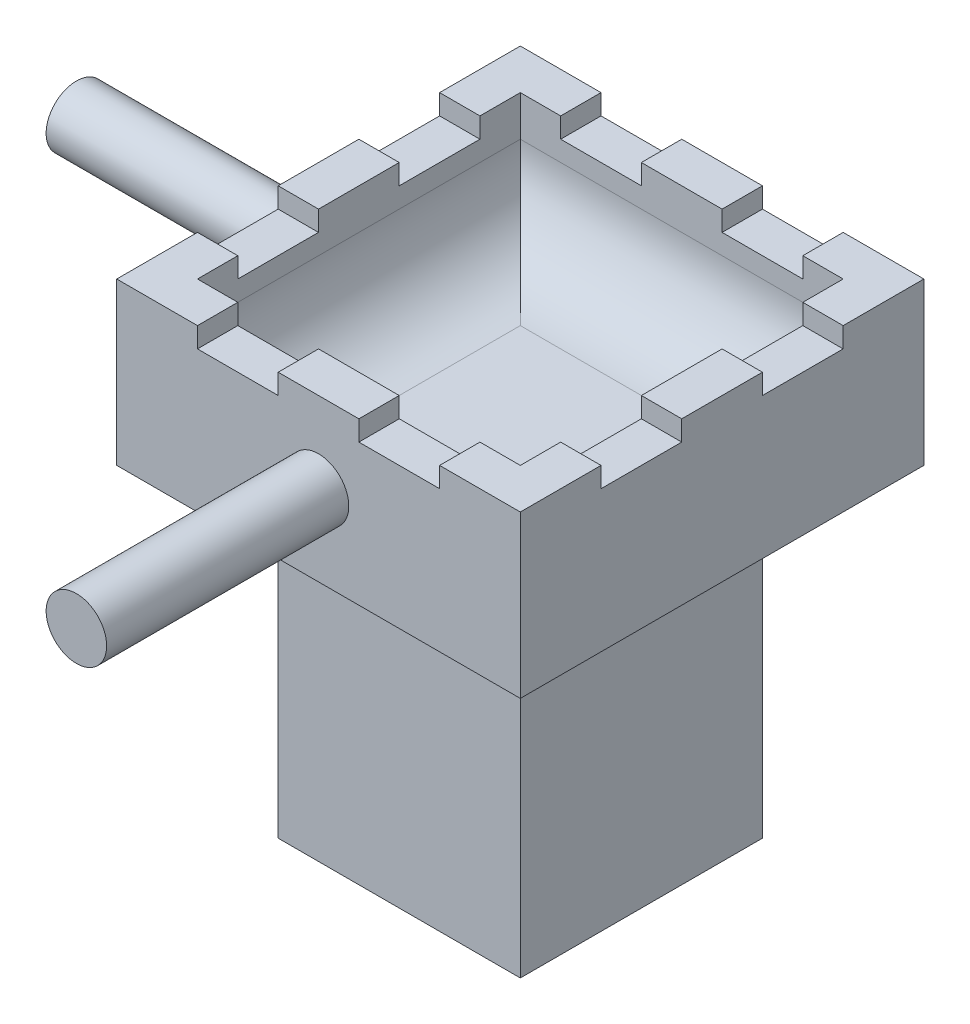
from build123d import *

# Parameters (mm, degrees)
SKETCH1_W                = 381
SKETCH1_H                = 381
BOSS_EXTRUDE1_DEPTH      = 152.4
SKETCH2_W                = 76.2
SKETCH2_H                = 76.2
BOSS_EXTRUDE2_DEPTH      = 152.4
SKETCH4_W                = 127
SKETCH4_H                = 127
CUT_EXTRUDE1_DEPTH       = 50.8
SKETCH5_W                = 127
SKETCH5_H                = 127
BOSS_EXTRUDE3_DEPTH      = 50.8
SHELL1_T                 = -12.7
SKETCH8_W                = 25.4
SKETCH8_H                = 6.35
CUT_EXTRUDE2_DEPTH       = 50.8
SKETCH9_W                = 25.4
SKETCH9_H                = 6.35
CUT_EXTRUDE3_DEPTH       = 50.8
SKETCH10_W               = 101.6
SKETCH10_H               = 101.6
CUT_EXTRUDE4_DEPTH       = 38.1
MIRROR5_COPY_1_SKETCH_W  = 25.4
MIRROR5_COPY_1_SKETCH_H  = 6.35
MIRROR5_COPY_1_DEPTH     = 50.8
MIRROR5_COPY_2_SKETCH_W  = 25.4
MIRROR5_COPY_2_SKETCH_H  = 6.35
MIRROR5_COPY_2_DEPTH     = 50.8
SKETCH11_W               = 127
SKETCH11_H               = 127
BOSS_EXTRUDE5_DEPTH      = 38.1
SKETCH14_W               = 136.818869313
SKETCH14_H               = 142.149474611
CUT_EXTRUDE8_DEPTH       = 50.8
SKETCH15_W               = 50.8
SKETCH15_H               = 50.8
BOSS_EXTRUDE6_DEPTH      = 241.3
SKETCH16_W               = 127
SKETCH16_H               = 127
BOSS_EXTRUDE7_DEPTH      = 50.8
SKETCH17_W               = 101.6
SKETCH17_H               = 101.6
CUT_EXTRUDE9_DEPTH       = 38.1
MIRROR9_COPY_1_SKETCH_W  = 25.4
MIRROR9_COPY_1_SKETCH_H  = 6.35
MIRROR9_COPY_1_DEPTH     = 50.8
MIRROR9_COPY_2_SKETCH_W  = 25.4
MIRROR9_COPY_2_SKETCH_H  = 6.35
MIRROR9_COPY_2_DEPTH     = 50.8
SKETCH18_W               = 222.108554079
SKETCH18_H               = 200.786132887
CUT_EXTRUDE10_DEPTH      = 50.8
SKETCH19_W               = 50.8
SKETCH19_H               = 50.8
BOSS_EXTRUDE8_DEPTH      = 241.3
SKETCH20_W               = 127
SKETCH20_H               = 127
BOSS_EXTRUDE9_DEPTH      = 50.8
SKETCH21_W               = 101.6
SKETCH21_H               = 101.6
CUT_EXTRUDE11_DEPTH      = 38.1
SKETCH23_W               = 25.4
SKETCH23_H               = 6.35
CUT_EXTRUDE12_DEPTH      = 152.4
SKETCH24_W               = 25.4
SKETCH24_H               = 6.35
CUT_EXTRUDE13_DEPTH      = 152.4
SKETCH25_W               = 76.2
SKETCH25_H               = 76.2
CUT_EXTRUDE14_DEPTH      = 152.4
SKETCH27_W               = 50.8
SKETCH27_H               = 50.8
BOSS_EXTRUDE10_DEPTH     = 254
FILLET1_R                = 25.4
SKETCH31_R               = 9.525
BOSS_EXTRUDE15_DEPTH     = 76.2
SKETCH32_R               = 9.525
BOSS_EXTRUDE16_DEPTH     = 76.2
BOSS_EXTRUDE17_START     = 76.2
SKETCH34_R               = 9.525
BOSS_EXTRUDE17_DEPTH     = 76.2
CUT_EXTRUDE16_DEPTH      = 748.468099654
CUT_EXTRUDE16_DEPTH_BACK = 748.468099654


with BuildPart() as part:
    # Sketch1 → Boss-Extrude1 (new body)
    with BuildSketch(Plane(origin=(0, 0, 0), x_dir=(1, 0, 0), z_dir=(0, 1, 0))):
        with Locations((190.5, 190.5)):
            Rectangle(SKETCH1_W, SKETCH1_H)
    extrude(amount=BOSS_EXTRUDE1_DEPTH)

    # Sketch2 → Boss-Extrude2 (add)
    with BuildSketch(Plane(origin=(0, 152.4, 0), x_dir=(-1, 0, 0), z_dir=(0, 1, 0))):
        with Locations((-38.1, -342.9)):
            Rectangle(SKETCH2_W, SKETCH2_H)
        with Locations((-342.9, -342.9)):
            Rectangle(SKETCH2_W, SKETCH2_H)
        with Locations((-342.9, -38.1)):
            Rectangle(SKETCH2_W, SKETCH2_H)
        with Locations((-38.1, -38.1)):
            Rectangle(SKETCH2_W, SKETCH2_H)
    extrude(amount=BOSS_EXTRUDE2_DEPTH)

    # Sketch4 → Cut-Extrude1 (cut)
    with BuildSketch(Plane(origin=(0, 304.8, 0), x_dir=(-1, 0, 0), z_dir=(0, 1, 0))):
        with Locations((-38.1, -342.9)):
            Rectangle(SKETCH4_W, SKETCH4_H)
    cut_extrude1 = extrude(amount=-CUT_EXTRUDE1_DEPTH, mode=Mode.SUBTRACT)

    # Sketch5 → Boss-Extrude3 (add)
    with BuildSketch(Plane(origin=(0, 254, 0), x_dir=(-1, 0, 0), z_dir=(0, 1, 0))):
        with Locations((-38.1, -342.9)):
            Rectangle(SKETCH5_W, SKETCH5_H)
    boss_extrude3 = extrude(amount=BOSS_EXTRUDE3_DEPTH)

    # Shell1
    shell1_openings = [part.faces().sort_by_distance(p)[0] for p in [
        (38.1, 304.8, -342.9),
    ]]
    offset(amount=SHELL1_T, openings=shell1_openings, kind=Kind.INTERSECTION)

    # Sketch8 → Cut-Extrude2 (cut)
    with BuildSketch(Plane.ZY.offset(25.4)):
        with Locations((-368.3, 301.625)):
            Rectangle(SKETCH8_W, SKETCH8_H)
        with Locations((-317.5, 301.625)):
            Rectangle(SKETCH8_W, SKETCH8_H)
    cut_extrude2 = extrude(amount=-CUT_EXTRUDE2_DEPTH, mode=Mode.SUBTRACT)

    # Mirror1: Cut-Extrude2 across plane
    add(cut_extrude2.mirror(Plane.ZY.offset(-38.1)), mode=Mode.SUBTRACT)

    # Sketch9 → Cut-Extrude3 (cut)
    with BuildSketch(Plane(origin=(0, 0, -406.4), x_dir=(-1, 0, 0), z_dir=(0, 0, -1))):
        with Locations((-63.5, 301.625)):
            Rectangle(SKETCH9_W, SKETCH9_H)
        with Locations((-12.7, 301.625)):
            Rectangle(SKETCH9_W, SKETCH9_H)
    cut_extrude3 = extrude(amount=-CUT_EXTRUDE3_DEPTH, mode=Mode.SUBTRACT)

    # Mirror2: Cut-Extrude3 across plane
    add(cut_extrude3.mirror(Plane(origin=(0, 0, -342.9), x_dir=(1, 0, 0), z_dir=(0, 0, -1))), mode=Mode.SUBTRACT)

    # Mirror4: Cut-Extrude1, Boss-Extrude3 across plane
    add(cut_extrude1.mirror(Plane(origin=(190.5, 0, 0), x_dir=(0, 0, 1), z_dir=(1, 0, 0))), mode=Mode.SUBTRACT)
    add(boss_extrude3.mirror(Plane(origin=(190.5, 0, 0), x_dir=(0, 0, 1), z_dir=(1, 0, 0))))

    # Sketch10 → Cut-Extrude4 (cut)
    with BuildSketch(Plane(origin=(0, 304.8, 0), x_dir=(-1, 0, 0), z_dir=(0, 1, 0))):
        with Locations((-342.9, -342.9)):
            Rectangle(SKETCH10_W, SKETCH10_H)
    cut_extrude4 = extrude(amount=-CUT_EXTRUDE4_DEPTH, mode=Mode.SUBTRACT)

    # Mirror5: Cut-Extrude2, Cut-Extrude3 across plane
    add(cut_extrude2.mirror(Plane(origin=(190.5, 0, 0), x_dir=(0, 0, 1), z_dir=(1, 0, 0))), mode=Mode.SUBTRACT)
    add(cut_extrude3.mirror(Plane(origin=(190.5, 0, 0), x_dir=(0, 0, 1), z_dir=(1, 0, 0))), mode=Mode.SUBTRACT)

    # Mirror5 copy 1 sketch → Mirror5 copy 1 (cut)
    with BuildSketch(Plane.ZY.offset(-279.4)):
        with Locations((-368.3, 301.625)):
            Rectangle(MIRROR5_COPY_1_SKETCH_W, MIRROR5_COPY_1_SKETCH_H)
        with Locations((-317.5, 301.625)):
            Rectangle(MIRROR5_COPY_1_SKETCH_W, MIRROR5_COPY_1_SKETCH_H)
    extrude(amount=-MIRROR5_COPY_1_DEPTH, mode=Mode.SUBTRACT)

    # Mirror5 copy 2 sketch → Mirror5 copy 2 (cut)
    with BuildSketch(Plane(origin=(381, 0, -279.4), x_dir=(1, 0, 0), z_dir=(0, 0, 1))):
        with Locations((-63.5, 301.625)):
            Rectangle(MIRROR5_COPY_2_SKETCH_W, MIRROR5_COPY_2_SKETCH_H)
        with Locations((-12.7, 301.625)):
            Rectangle(MIRROR5_COPY_2_SKETCH_W, MIRROR5_COPY_2_SKETCH_H)
    extrude(amount=-MIRROR5_COPY_2_DEPTH, mode=Mode.SUBTRACT)

    # Mirror6: Cut-Extrude4 across plane
    add(cut_extrude4.mirror(Plane.XY.offset(-190.5)), mode=Mode.SUBTRACT)

    # Sketch11 → Boss-Extrude5 (add)
    with BuildSketch(Plane(origin=(0, 266.7, 0), x_dir=(-1, 0, 0), z_dir=(0, 1, 0))):
        with Locations((-342.9, -38.1)):
            Rectangle(SKETCH11_W, SKETCH11_H)
    extrude(amount=BOSS_EXTRUDE5_DEPTH)

    # Sketch14 → Cut-Extrude8 (cut)
    with BuildSketch(Plane(origin=(0, 304.8, 0), x_dir=(-1, 0, 0), z_dir=(0, 1, 0))):
        with Locations((-39.844920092, -29.314669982)):
            Rectangle(SKETCH14_W, SKETCH14_H)
    extrude(amount=-CUT_EXTRUDE8_DEPTH, mode=Mode.SUBTRACT)

    # Sketch15 → Boss-Extrude6 (add)
    with BuildSketch(Plane(origin=(0, 12.7, 0), x_dir=(-1, 0, 0), z_dir=(0, 1, 0))):
        with Locations((-38.1, -38.1)):
            Rectangle(SKETCH15_W, SKETCH15_H)
    extrude(amount=BOSS_EXTRUDE6_DEPTH)

    # Sketch16 → Boss-Extrude7 (add)
    with BuildSketch(Plane(origin=(0, 254, 0), x_dir=(-1, 0, 0), z_dir=(0, 1, 0))):
        with Locations((-38.1, -38.1)):
            Rectangle(SKETCH16_W, SKETCH16_H)
    extrude(amount=BOSS_EXTRUDE7_DEPTH)

    # Sketch17 → Cut-Extrude9 (cut)
    with BuildSketch(Plane(origin=(0, 304.8, 0), x_dir=(-1, 0, 0), z_dir=(0, 1, 0))):
        with Locations((-38.1, -38.1)):
            Rectangle(SKETCH17_W, SKETCH17_H)
    extrude(amount=-CUT_EXTRUDE9_DEPTH, mode=Mode.SUBTRACT)

    # Mirror9: Cut-Extrude2, Cut-Extrude3 across plane
    add(cut_extrude2.mirror(Plane.XY.offset(-190.5)), mode=Mode.SUBTRACT)
    add(cut_extrude3.mirror(Plane.XY.offset(-190.5)), mode=Mode.SUBTRACT)

    # Mirror9 copy 1 sketch → Mirror9 copy 1 (cut)
    with BuildSketch(Plane(origin=(101.6, 0, -381), x_dir=(0, 0, -1), z_dir=(1, 0, 0))):
        with Locations((-368.3, 301.625)):
            Rectangle(MIRROR9_COPY_1_SKETCH_W, MIRROR9_COPY_1_SKETCH_H)
        with Locations((-317.5, 301.625)):
            Rectangle(MIRROR9_COPY_1_SKETCH_W, MIRROR9_COPY_1_SKETCH_H)
    extrude(amount=-MIRROR9_COPY_1_DEPTH, mode=Mode.SUBTRACT)

    # Mirror9 copy 2 sketch → Mirror9 copy 2 (cut)
    with BuildSketch(Plane(origin=(0, 0, -101.6), x_dir=(-1, 0, 0), z_dir=(0, 0, -1))):
        with Locations((-63.5, 301.625)):
            Rectangle(MIRROR9_COPY_2_SKETCH_W, MIRROR9_COPY_2_SKETCH_H)
        with Locations((-12.7, 301.625)):
            Rectangle(MIRROR9_COPY_2_SKETCH_W, MIRROR9_COPY_2_SKETCH_H)
    extrude(amount=-MIRROR9_COPY_2_DEPTH, mode=Mode.SUBTRACT)

    # Sketch18 → Cut-Extrude10 (cut)
    with BuildSketch(Plane(origin=(0, 304.8, 0), x_dir=(-1, 0, 0), z_dir=(0, 1, 0))):
        with Locations((-342.800987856, -34.645275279)):
            Rectangle(SKETCH18_W, SKETCH18_H)
    extrude(amount=-CUT_EXTRUDE10_DEPTH, mode=Mode.SUBTRACT)

    # Sketch19 → Boss-Extrude8 (add)
    with BuildSketch(Plane(origin=(0, 12.7, 0), x_dir=(-1, 0, 0), z_dir=(0, 1, 0))):
        with Locations((-342.9, -38.1)):
            Rectangle(SKETCH19_W, SKETCH19_H)
    extrude(amount=BOSS_EXTRUDE8_DEPTH)

    # Sketch20 → Boss-Extrude9 (add)
    with BuildSketch(Plane(origin=(0, 254, 0), x_dir=(-1, 0, 0), z_dir=(0, 1, 0))):
        with Locations((-342.9, -38.1)):
            Rectangle(SKETCH20_W, SKETCH20_H)
    extrude(amount=BOSS_EXTRUDE9_DEPTH)

    # Sketch21 → Cut-Extrude11 (cut)
    with BuildSketch(Plane(origin=(0, 304.8, 0), x_dir=(-1, 0, 0), z_dir=(0, 1, 0))):
        with Locations((-342.9, -38.1)):
            Rectangle(SKETCH21_W, SKETCH21_H)
    extrude(amount=-CUT_EXTRUDE11_DEPTH, mode=Mode.SUBTRACT)

    # Sketch23 → Cut-Extrude12 (cut)
    with BuildSketch(Plane.XY.offset(25.4)):
        with Locations((317.5, 301.625)):
            Rectangle(SKETCH23_W, SKETCH23_H)
        with Locations((368.3, 301.625)):
            Rectangle(SKETCH23_W, SKETCH23_H)
    extrude(amount=-CUT_EXTRUDE12_DEPTH, mode=Mode.SUBTRACT)

    # Sketch24 → Cut-Extrude13 (cut)
    with BuildSketch(Plane(origin=(406.4, 0, 0), x_dir=(0, 0, -1), z_dir=(1, 0, 0))):
        with Locations((12.7, 301.625)):
            Rectangle(SKETCH24_W, SKETCH24_H)
        with Locations((63.5, 301.625)):
            Rectangle(SKETCH24_W, SKETCH24_H)
    extrude(amount=-CUT_EXTRUDE13_DEPTH, mode=Mode.SUBTRACT)

    # Sketch25 → Cut-Extrude14 (cut)
    with BuildSketch(Plane.XY):
        with Locations((190.5, 57.15)):
            Rectangle(SKETCH25_W, SKETCH25_H)
        with BuildLine():
            ThreePointArc((152.4, 95.25), (190.5, 133.35), (228.6, 95.25))
            Line((228.6, 95.25), (152.4, 95.25))
        make_face()
    extrude(amount=-CUT_EXTRUDE14_DEPTH, mode=Mode.SUBTRACT)

    # Sketch27 → Boss-Extrude10 (add)
    with BuildSketch(Plane(origin=(0, 12.7, 0), x_dir=(1, 0, 0), z_dir=(0, 1, 0))):
        with Locations((38.1, 342.9)):
            Rectangle(SKETCH27_W, SKETCH27_H)
    extrude(amount=BOSS_EXTRUDE10_DEPTH)

    # Fillet1
    fillet1_edges = [part.edges().sort_by_distance(p)[0] for p in [
        (88.9, 266.7, -342.9),
        (38.1, 266.7, -393.7),
        (-12.7, 266.7, -342.9),
        (38.1, 266.7, -292.1),
        (342.9, 266.7, -393.7),
        (292.1, 266.7, -342.9),
        (342.9, 266.7, -292.1),
        (393.7, 266.7, -342.9),
        (38.1, 266.7, -88.9),
        (-12.7, 266.7, -38.1),
        (38.1, 266.7, 12.7),
        (88.9, 266.7, -38.1),
        (342.9, 266.7, -88.9),
        (292.1, 266.7, -38.1),
        (342.9, 266.7, 12.7),
        (393.7, 266.7, -38.1),
    ]]
    fillet(fillet1_edges, radius=FILLET1_R)

    # Sketch31 → Boss-Extrude15 (add)
    with BuildSketch(Plane.XY.offset(25.4)):
        with Locations(Location((38.1, 279.4, 0), (0, 0, 180))):
            Circle(SKETCH31_R)
        with Locations(Location((342.9, 279.4, 0), (0, 0, 180))):
            Circle(SKETCH31_R)
    boss_extrude15 = extrude(amount=BOSS_EXTRUDE15_DEPTH)

    # Sketch32 → Boss-Extrude16 (add)
    with BuildSketch(Plane.ZY.offset(25.4)):
        with Locations(Location((-38.1, 279.4, 0), (0, 0, 180))):
            Circle(SKETCH32_R)
    boss_extrude16 = extrude(amount=BOSS_EXTRUDE16_DEPTH)

    # Sketch34 → Boss-Extrude17 (add)
    with BuildSketch(Plane(origin=(406.4, 0, 0), x_dir=(0, 0, -1), z_dir=(1, 0, 0)).offset(BOSS_EXTRUDE17_START)):
        with Locations((38.1, 279.4)):
            Circle(SKETCH34_R)
    boss_extrude17 = extrude(amount=-BOSS_EXTRUDE17_DEPTH)

    # Mirror10: Boss-Extrude15, Boss-Extrude16, Boss-Extrude17 across plane
    add(boss_extrude15.mirror(Plane.XY.offset(-190.5)))
    add(boss_extrude16.mirror(Plane.XY.offset(-190.5)))
    add(boss_extrude17.mirror(Plane.XY.offset(-190.5)))

    # Sketch35 → Cut-Extrude16 (cut, two sides: drawn at the far end of the back side and taken through both)
    with BuildSketch(Plane.XY.offset(-CUT_EXTRUDE16_DEPTH_BACK)):
        Polygon((-1388.945355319, 152.4), (-125.375161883, 152.4), (497.192744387, 152.4), (1760.762937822, 152.4), (1760.762937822, -2374.74038687), (-1388.945355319, -2374.74038687), align=None)
    extrude(amount=CUT_EXTRUDE16_DEPTH + CUT_EXTRUDE16_DEPTH_BACK, mode=Mode.SUBTRACT)


with BuildPart() as body_2:
    # of the pieces the cut leaves, the one that is kept (cut_extrude16_keep)
    add(part.part.solids().sort_by_distance((0, 254, 0))[0])


solid = body_2.part
